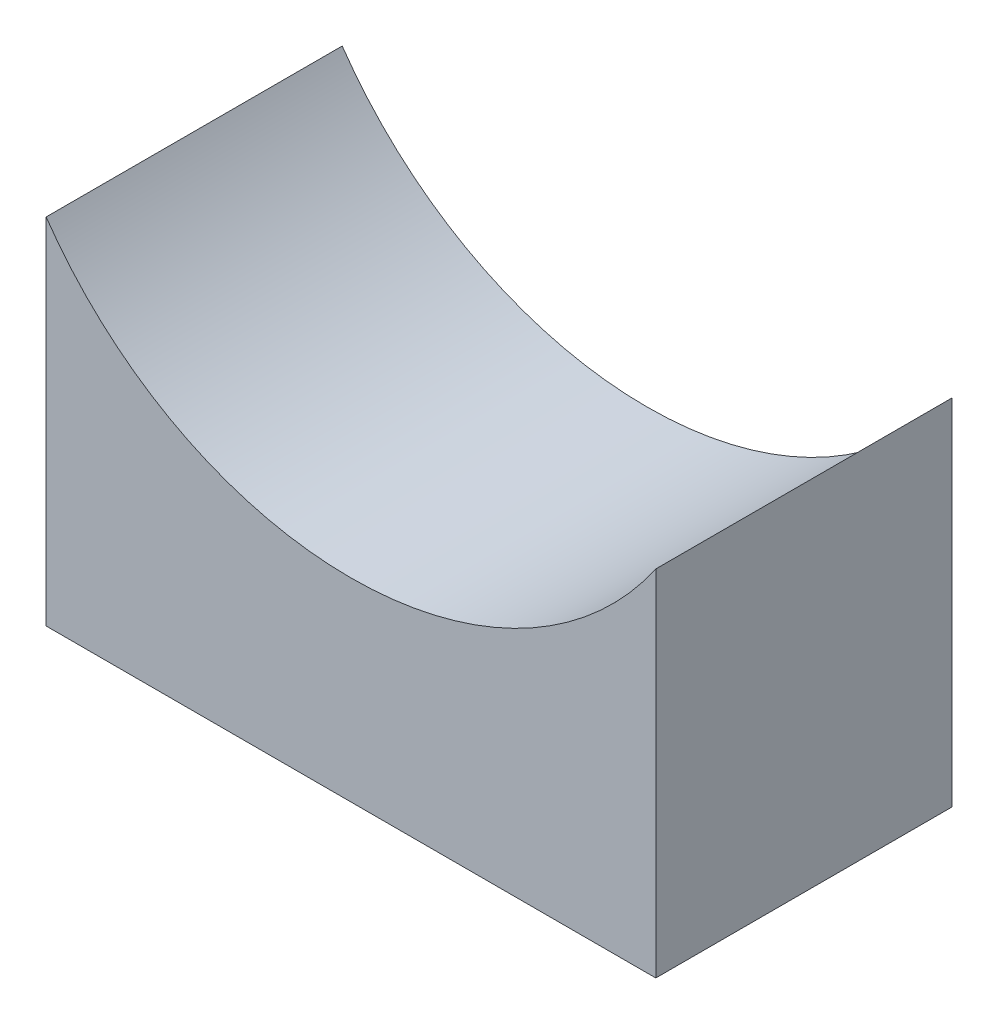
from build123d import *

# Parameters (mm, degrees)
BOSS_EXTRUDE1_DEPTH = 200


with BuildPart() as part:
    # Sketch1 → Boss-Extrude1 (new body)
    with BuildSketch(Plane.XY):
        with BuildLine():
            ThreePointArc((205.914158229, -141.772209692), (0, -250), (-205.914158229, -141.772209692))
            Line((-205.914158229, -141.772209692), (-205.914158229, -381.075655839))
            Line((-205.914158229, -381.075655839), (146.799593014, -381.075655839))
            Line((146.799593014, -381.075655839), (197.073426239, -381.075655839))
            Line((197.073426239, -381.075655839), (205.914158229, -381.075655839))
            Line((205.914158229, -381.075655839), (205.914158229, -141.772209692))
        make_face()
    extrude(amount=BOSS_EXTRUDE1_DEPTH)


solid = part.part
